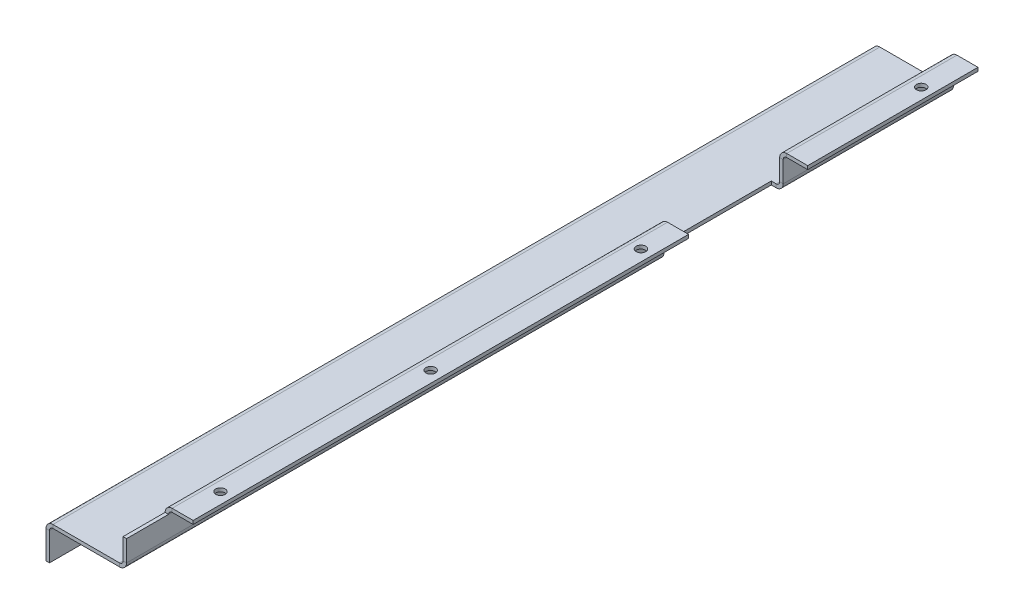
ISO-10303-21;
HEADER;
FILE_DESCRIPTION(('STEP AP214'),'2;1');
FILE_NAME('part.step','',(''),(''),'','','');
FILE_SCHEMA(('AUTOMOTIVE_DESIGN { 1 0 10303 214 1 1 1 1 }'));
ENDSEC;
DATA;
#1=APPLICATION_CONTEXT('core data for automotive mechanical design processes');
#2=APPLICATION_PROTOCOL_DEFINITION('international standard','automotive_design',2000,#1);
#3=PRODUCT_CONTEXT('',#1,'mechanical');
#4=PRODUCT('Part','Part','',(#3));
#5=PRODUCT_RELATED_PRODUCT_CATEGORY('part','',(#4));
#6=PRODUCT_DEFINITION_FORMATION('','',#4);
#7=PRODUCT_DEFINITION_CONTEXT('part definition',#1,'design');
#8=PRODUCT_DEFINITION('design','',#6,#7);
#9=PRODUCT_DEFINITION_SHAPE('','',#8);
#10=(LENGTH_UNIT() NAMED_UNIT(*) SI_UNIT(.MILLI.,.METRE.));
#11=(NAMED_UNIT(*) PLANE_ANGLE_UNIT() SI_UNIT($,.RADIAN.));
#12=(NAMED_UNIT(*) SI_UNIT($,.STERADIAN.) SOLID_ANGLE_UNIT());
#13=UNCERTAINTY_MEASURE_WITH_UNIT(LENGTH_MEASURE(1.E-05),#10,'distance_accuracy_value','');
#14=(GEOMETRIC_REPRESENTATION_CONTEXT(3) GLOBAL_UNCERTAINTY_ASSIGNED_CONTEXT((#13)) GLOBAL_UNIT_ASSIGNED_CONTEXT((#10,
#11,#12)) REPRESENTATION_CONTEXT('',''));
#15=CARTESIAN_POINT('',(0.,0.,0.));
#16=DIRECTION('',(0.,0.,1.));
#17=DIRECTION('',(1.,0.,0.));
#18=AXIS2_PLACEMENT_3D('',#15,#16,#17);
#19=CARTESIAN_POINT('',(55.,44.9999999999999,-590.));
#20=DIRECTION('',(0.,-1.,0.));
#21=DIRECTION('',(0.,0.,-1.));
#22=AXIS2_PLACEMENT_3D('',#19,#20,#21);
#23=PLANE('',#22);
#24=CARTESIAN_POINT('',(66.9999999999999,44.9999999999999,-557.5));
#25=DIRECTION('',(0.,-1.,0.));
#26=DIRECTION('',(0.,0.,-1.));
#27=AXIS2_PLACEMENT_3D('',#24,#25,#26);
#28=CIRCLE('',#27,3.39999999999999);
#29=CARTESIAN_POINT('',(66.9999999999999,44.9999999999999,-560.9));
#30=VERTEX_POINT('',#29);
#31=EDGE_CURVE('E820',#30,#30,#28,.T.);
#32=ORIENTED_EDGE('',*,*,#31,.F.);
#33=EDGE_LOOP('',(#32));
#34=FACE_BOUND('',#33,.T.);
#35=DIRECTION('',(0.,0.,1.));
#36=VECTOR('',#35,1.);
#37=CARTESIAN_POINT('',(75.,44.9999999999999,-590.));
#38=LINE('',#37,#36);
#39=CARTESIAN_POINT('',(75.,44.9999999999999,-590.));
#40=VERTEX_POINT('',#39);
#41=CARTESIAN_POINT('',(75.,44.9999999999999,-468.5));
#42=VERTEX_POINT('',#41);
#43=EDGE_CURVE('E300',#40,#42,#38,.T.);
#44=ORIENTED_EDGE('',*,*,#43,.T.);
#45=DIRECTION('',(1.,0.,0.));
#46=VECTOR('',#45,1.);
#47=CARTESIAN_POINT('',(54.9999999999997,44.9999999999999,-468.5));
#48=LINE('',#47,#46);
#49=CARTESIAN_POINT('',(60.,44.9999999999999,-468.5));
#50=VERTEX_POINT('',#49);
#51=EDGE_CURVE('E642',#50,#42,#48,.T.);
#52=ORIENTED_EDGE('',*,*,#51,.F.);
#53=DIRECTION('',(0.,0.,1.));
#54=VECTOR('',#53,1.);
#55=CARTESIAN_POINT('',(60.,44.9999999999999,-590.));
#56=LINE('',#55,#54);
#57=CARTESIAN_POINT('',(60.,44.9999999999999,-590.));
#58=VERTEX_POINT('',#57);
#59=EDGE_CURVE('E309',#58,#50,#56,.T.);
#60=ORIENTED_EDGE('',*,*,#59,.F.);
#61=DIRECTION('',(1.,0.,0.));
#62=VECTOR('',#61,1.);
#63=CARTESIAN_POINT('',(55.,44.9999999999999,-590.));
#64=LINE('',#63,#62);
#65=EDGE_CURVE('E479',#58,#40,#64,.T.);
#66=ORIENTED_EDGE('',*,*,#65,.T.);
#67=EDGE_LOOP('',(#44,#52,#60,#66));
#68=FACE_BOUND('',#67,.T.);
#69=ADVANCED_FACE('F38',(#34,#68),#23,.T.);
#70=CARTESIAN_POINT('',(66.9999999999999,44.9999999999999,-207.5));
#71=DIRECTION('',(0.,-1.,0.));
#72=DIRECTION('',(0.,0.,-1.));
#73=AXIS2_PLACEMENT_3D('',#70,#71,#72);
#74=CIRCLE('',#73,3.39999999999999);
#75=CARTESIAN_POINT('',(66.9999999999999,44.9999999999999,-210.9));
#76=VERTEX_POINT('',#75);
#77=EDGE_CURVE('E823',#76,#76,#74,.T.);
#78=ORIENTED_EDGE('',*,*,#77,.F.);
#79=EDGE_LOOP('',(#78));
#80=FACE_BOUND('',#79,.T.);
#81=CARTESIAN_POINT('',(66.9999999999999,44.9999999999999,-357.5));
#82=DIRECTION('',(0.,-1.,0.));
#83=DIRECTION('',(0.,0.,-1.));
#84=AXIS2_PLACEMENT_3D('',#81,#82,#83);
#85=CIRCLE('',#84,3.39999999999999);
#86=CARTESIAN_POINT('',(66.9999999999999,44.9999999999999,-360.9));
#87=VERTEX_POINT('',#86);
#88=EDGE_CURVE('E813',#87,#87,#85,.T.);
#89=ORIENTED_EDGE('',*,*,#88,.F.);
#90=EDGE_LOOP('',(#89));
#91=FACE_BOUND('',#90,.T.);
#92=CARTESIAN_POINT('',(66.9999999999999,44.9999999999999,-57.5));
#93=DIRECTION('',(0.,-1.,0.));
#94=DIRECTION('',(0.,0.,-1.));
#95=AXIS2_PLACEMENT_3D('',#92,#93,#94);
#96=CIRCLE('',#95,3.39999999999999);
#97=CARTESIAN_POINT('',(66.9999999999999,44.9999999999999,-60.9));
#98=VERTEX_POINT('',#97);
#99=EDGE_CURVE('E834',#98,#98,#96,.T.);
#100=ORIENTED_EDGE('',*,*,#99,.F.);
#101=EDGE_LOOP('',(#100));
#102=FACE_BOUND('',#101,.T.);
#103=CARTESIAN_POINT('',(60.,44.9999999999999,-383.5));
#104=VERTEX_POINT('',#103);
#105=CARTESIAN_POINT('',(60.,44.9999999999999,-30.));
#106=VERTEX_POINT('',#105);
#107=EDGE_CURVE('E410',#104,#106,#56,.T.);
#108=ORIENTED_EDGE('',*,*,#107,.F.);
#109=DIRECTION('',(-1.,0.,0.));
#110=VECTOR('',#109,1.);
#111=CARTESIAN_POINT('',(55.,44.9999999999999,-383.5));
#112=LINE('',#111,#110);
#113=CARTESIAN_POINT('',(75.,44.9999999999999,-383.5));
#114=VERTEX_POINT('',#113);
#115=EDGE_CURVE('E644',#114,#104,#112,.T.);
#116=ORIENTED_EDGE('',*,*,#115,.F.);
#117=CARTESIAN_POINT('',(75.,44.9999999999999,-30.));
#118=VERTEX_POINT('',#117);
#119=EDGE_CURVE('E62',#114,#118,#38,.T.);
#120=ORIENTED_EDGE('',*,*,#119,.T.);
#121=DIRECTION('',(1.,0.,0.));
#122=VECTOR('',#121,1.);
#123=CARTESIAN_POINT('',(54.9999999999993,44.9999999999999,-30.));
#124=LINE('',#123,#122);
#125=EDGE_CURVE('E720',#106,#118,#124,.T.);
#126=ORIENTED_EDGE('',*,*,#125,.F.);
#127=EDGE_LOOP('',(#108,#116,#120,#126));
#128=FACE_BOUND('',#127,.T.);
#129=ADVANCED_FACE('F554',(#80,#91,#102,#128),#23,.T.);
#130=CARTESIAN_POINT('',(60.,42.5,-590.));
#131=DIRECTION('',(0.,0.,1.));
#132=DIRECTION('',(1.,0.,0.));
#133=AXIS2_PLACEMENT_3D('',#130,#131,#132);
#134=CYLINDRICAL_SURFACE('',#133,2.5);
#135=ORIENTED_EDGE('',*,*,#59,.T.);
#136=CARTESIAN_POINT('',(60.,42.5,-468.5));
#137=DIRECTION('',(0.,0.,1.));
#138=DIRECTION('',(1.,0.,0.));
#139=AXIS2_PLACEMENT_3D('',#136,#137,#138);
#140=CIRCLE('',#139,2.5);
#141=CARTESIAN_POINT('',(57.5,42.5,-468.5));
#142=VERTEX_POINT('',#141);
#143=EDGE_CURVE('E510',#142,#50,#140,.F.);
#144=ORIENTED_EDGE('',*,*,#143,.F.);
#145=DIRECTION('',(0.,0.,1.));
#146=VECTOR('',#145,1.);
#147=CARTESIAN_POINT('',(57.5,42.5,-590.));
#148=LINE('',#147,#146);
#149=CARTESIAN_POINT('',(57.5,42.5,-590.));
#150=VERTEX_POINT('',#149);
#151=EDGE_CURVE('E411',#150,#142,#148,.T.);
#152=ORIENTED_EDGE('',*,*,#151,.F.);
#153=CARTESIAN_POINT('',(60.,42.5,-590.));
#154=DIRECTION('',(0.,0.,1.));
#155=DIRECTION('',(1.,0.,0.));
#156=AXIS2_PLACEMENT_3D('',#153,#154,#155);
#157=CIRCLE('',#156,2.5);
#158=EDGE_CURVE('E403',#150,#58,#157,.F.);
#159=ORIENTED_EDGE('',*,*,#158,.T.);
#160=EDGE_LOOP('',(#135,#144,#152,#159));
#161=FACE_BOUND('',#160,.T.);
#162=ADVANCED_FACE('F508',(#161),#134,.F.);
#163=CARTESIAN_POINT('',(57.5,42.5,-383.5));
#164=VERTEX_POINT('',#163);
#165=CARTESIAN_POINT('',(57.5,42.5,-30.));
#166=VERTEX_POINT('',#165);
#167=EDGE_CURVE('E415',#164,#166,#148,.T.);
#168=ORIENTED_EDGE('',*,*,#167,.F.);
#169=CARTESIAN_POINT('',(60.,42.5,-383.5));
#170=DIRECTION('',(0.,0.,1.));
#171=DIRECTION('',(1.,0.,0.));
#172=AXIS2_PLACEMENT_3D('',#169,#170,#171);
#173=CIRCLE('',#172,2.5);
#174=EDGE_CURVE('E781',#104,#164,#173,.T.);
#175=ORIENTED_EDGE('',*,*,#174,.F.);
#176=ORIENTED_EDGE('',*,*,#107,.T.);
#177=CARTESIAN_POINT('',(60.,42.5,-30.));
#178=DIRECTION('',(0.,0.,-1.));
#179=DIRECTION('',(-1.,0.,0.));
#180=AXIS2_PLACEMENT_3D('',#177,#178,#179);
#181=CIRCLE('',#180,2.5);
#182=EDGE_CURVE('E705',#166,#106,#181,.T.);
#183=ORIENTED_EDGE('',*,*,#182,.F.);
#184=EDGE_LOOP('',(#168,#175,#176,#183));
#185=FACE_BOUND('',#184,.T.);
#186=ADVANCED_FACE('F608',(#185),#134,.F.);
#187=CARTESIAN_POINT('',(60.,42.5,-590.));
#188=DIRECTION('',(0.,0.,1.));
#189=DIRECTION('',(1.,0.,0.));
#190=AXIS2_PLACEMENT_3D('',#187,#188,#189);
#191=CYLINDRICAL_SURFACE('',#190,5.);
#192=CARTESIAN_POINT('',(60.,42.5,-468.5));
#193=DIRECTION('',(0.,0.,-1.));
#194=DIRECTION('',(-1.,0.,0.));
#195=AXIS2_PLACEMENT_3D('',#192,#193,#194);
#196=CIRCLE('',#195,5.);
#197=CARTESIAN_POINT('',(55.,42.5,-468.5));
#198=VERTEX_POINT('',#197);
#199=CARTESIAN_POINT('',(60.,47.5000000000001,-468.5));
#200=VERTEX_POINT('',#199);
#201=EDGE_CURVE('E778',#198,#200,#196,.T.);
#202=ORIENTED_EDGE('',*,*,#201,.T.);
#203=DIRECTION('',(0.,0.,1.));
#204=VECTOR('',#203,1.);
#205=CARTESIAN_POINT('',(60.,47.5000000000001,-590.));
#206=LINE('',#205,#204);
#207=CARTESIAN_POINT('',(60.,47.5000000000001,-590.));
#208=VERTEX_POINT('',#207);
#209=EDGE_CURVE('E290',#208,#200,#206,.T.);
#210=ORIENTED_EDGE('',*,*,#209,.F.);
#211=CARTESIAN_POINT('',(60.,42.5,-590.));
#212=DIRECTION('',(0.,0.,1.));
#213=DIRECTION('',(1.,0.,0.));
#214=AXIS2_PLACEMENT_3D('',#211,#212,#213);
#215=CIRCLE('',#214,5.);
#216=CARTESIAN_POINT('',(55.,42.5,-590.));
#217=VERTEX_POINT('',#216);
#218=EDGE_CURVE('E489',#217,#208,#215,.F.);
#219=ORIENTED_EDGE('',*,*,#218,.F.);
#220=DIRECTION('',(0.,0.,1.));
#221=VECTOR('',#220,1.);
#222=CARTESIAN_POINT('',(55.,42.5,-590.));
#223=LINE('',#222,#221);
#224=EDGE_CURVE('E284',#217,#198,#223,.T.);
#225=ORIENTED_EDGE('',*,*,#224,.T.);
#226=EDGE_LOOP('',(#202,#210,#219,#225));
#227=FACE_BOUND('',#226,.T.);
#228=ADVANCED_FACE('F501',(#227),#191,.T.);
#229=CARTESIAN_POINT('',(60.,42.5,-383.5));
#230=DIRECTION('',(0.,0.,1.));
#231=DIRECTION('',(1.,0.,0.));
#232=AXIS2_PLACEMENT_3D('',#229,#230,#231);
#233=CIRCLE('',#232,5.);
#234=CARTESIAN_POINT('',(60.,47.5000000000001,-383.5));
#235=VERTEX_POINT('',#234);
#236=CARTESIAN_POINT('',(55.,42.5,-383.5));
#237=VERTEX_POINT('',#236);
#238=EDGE_CURVE('E774',#235,#237,#233,.T.);
#239=ORIENTED_EDGE('',*,*,#238,.T.);
#240=CARTESIAN_POINT('',(55.,42.5,-30.));
#241=VERTEX_POINT('',#240);
#242=EDGE_CURVE('E289',#237,#241,#223,.T.);
#243=ORIENTED_EDGE('',*,*,#242,.T.);
#244=CARTESIAN_POINT('',(60.,42.5,-30.));
#245=DIRECTION('',(0.,0.,1.));
#246=DIRECTION('',(1.,0.,0.));
#247=AXIS2_PLACEMENT_3D('',#244,#245,#246);
#248=CIRCLE('',#247,5.);
#249=CARTESIAN_POINT('',(60.,47.5000000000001,-30.));
#250=VERTEX_POINT('',#249);
#251=EDGE_CURVE('E712',#241,#250,#248,.F.);
#252=ORIENTED_EDGE('',*,*,#251,.T.);
#253=EDGE_CURVE('E294',#235,#250,#206,.T.);
#254=ORIENTED_EDGE('',*,*,#253,.F.);
#255=EDGE_LOOP('',(#239,#243,#252,#254));
#256=FACE_BOUND('',#255,.T.);
#257=ADVANCED_FACE('F607',(#256),#191,.T.);
#258=CARTESIAN_POINT('',(55.,47.5000000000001,-590.));
#259=DIRECTION('',(0.,-1.,0.));
#260=DIRECTION('',(0.,0.,-1.));
#261=AXIS2_PLACEMENT_3D('',#258,#259,#260);
#262=PLANE('',#261);
#263=CARTESIAN_POINT('',(66.9999999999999,47.5000000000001,-557.5));
#264=DIRECTION('',(0.,1.,0.));
#265=DIRECTION('',(0.,0.,1.));
#266=AXIS2_PLACEMENT_3D('',#263,#264,#265);
#267=CIRCLE('',#266,3.39999999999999);
#268=CARTESIAN_POINT('',(66.9999999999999,47.5000000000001,-554.1));
#269=VERTEX_POINT('',#268);
#270=EDGE_CURVE('E622',#269,#269,#267,.T.);
#271=ORIENTED_EDGE('',*,*,#270,.F.);
#272=EDGE_LOOP('',(#271));
#273=FACE_BOUND('',#272,.T.);
#274=DIRECTION('',(1.,0.,0.));
#275=VECTOR('',#274,1.);
#276=CARTESIAN_POINT('',(55.,47.5000000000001,-468.5));
#277=LINE('',#276,#275);
#278=CARTESIAN_POINT('',(75.,47.5000000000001,-468.5));
#279=VERTEX_POINT('',#278);
#280=EDGE_CURVE('E625',#200,#279,#277,.T.);
#281=ORIENTED_EDGE('',*,*,#280,.T.);
#282=DIRECTION('',(0.,0.,1.));
#283=VECTOR('',#282,1.);
#284=CARTESIAN_POINT('',(75.,47.5000000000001,-590.));
#285=LINE('',#284,#283);
#286=CARTESIAN_POINT('',(75.,47.5000000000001,-590.));
#287=VERTEX_POINT('',#286);
#288=EDGE_CURVE('E295',#287,#279,#285,.T.);
#289=ORIENTED_EDGE('',*,*,#288,.F.);
#290=DIRECTION('',(1.,0.,0.));
#291=VECTOR('',#290,1.);
#292=CARTESIAN_POINT('',(55.,47.5000000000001,-590.));
#293=LINE('',#292,#291);
#294=EDGE_CURVE('E486',#208,#287,#293,.T.);
#295=ORIENTED_EDGE('',*,*,#294,.F.);
#296=ORIENTED_EDGE('',*,*,#209,.T.);
#297=EDGE_LOOP('',(#281,#289,#295,#296));
#298=FACE_BOUND('',#297,.T.);
#299=ADVANCED_FACE('F609',(#273,#298),#262,.F.);
#300=CARTESIAN_POINT('',(66.9999999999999,47.5000000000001,-207.5));
#301=DIRECTION('',(0.,1.,0.));
#302=DIRECTION('',(0.,0.,1.));
#303=AXIS2_PLACEMENT_3D('',#300,#301,#302);
#304=CIRCLE('',#303,3.39999999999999);
#305=CARTESIAN_POINT('',(66.9999999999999,47.5000000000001,-204.1));
#306=VERTEX_POINT('',#305);
#307=EDGE_CURVE('E1446',#306,#306,#304,.T.);
#308=ORIENTED_EDGE('',*,*,#307,.F.);
#309=EDGE_LOOP('',(#308));
#310=FACE_BOUND('',#309,.T.);
#311=CARTESIAN_POINT('',(66.9999999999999,47.5000000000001,-357.5));
#312=DIRECTION('',(0.,1.,0.));
#313=DIRECTION('',(0.,0.,1.));
#314=AXIS2_PLACEMENT_3D('',#311,#312,#313);
#315=CIRCLE('',#314,3.39999999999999);
#316=CARTESIAN_POINT('',(66.9999999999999,47.5000000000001,-354.1));
#317=VERTEX_POINT('',#316);
#318=EDGE_CURVE('E815',#317,#317,#315,.T.);
#319=ORIENTED_EDGE('',*,*,#318,.F.);
#320=EDGE_LOOP('',(#319));
#321=FACE_BOUND('',#320,.T.);
#322=CARTESIAN_POINT('',(66.9999999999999,47.5000000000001,-57.5));
#323=DIRECTION('',(0.,1.,0.));
#324=DIRECTION('',(0.,0.,1.));
#325=AXIS2_PLACEMENT_3D('',#322,#323,#324);
#326=CIRCLE('',#325,3.39999999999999);
#327=CARTESIAN_POINT('',(66.9999999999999,47.5000000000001,-54.1));
#328=VERTEX_POINT('',#327);
#329=EDGE_CURVE('E830',#328,#328,#326,.T.);
#330=ORIENTED_EDGE('',*,*,#329,.F.);
#331=EDGE_LOOP('',(#330));
#332=FACE_BOUND('',#331,.T.);
#333=DIRECTION('',(1.,0.,0.));
#334=VECTOR('',#333,1.);
#335=CARTESIAN_POINT('',(55.,47.5000000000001,-383.5));
#336=LINE('',#335,#334);
#337=CARTESIAN_POINT('',(75.,47.5000000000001,-383.5));
#338=VERTEX_POINT('',#337);
#339=EDGE_CURVE('E632',#338,#235,#336,.F.);
#340=ORIENTED_EDGE('',*,*,#339,.T.);
#341=ORIENTED_EDGE('',*,*,#253,.T.);
#342=DIRECTION('',(1.,0.,0.));
#343=VECTOR('',#342,1.);
#344=CARTESIAN_POINT('',(55.,47.5000000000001,-30.));
#345=LINE('',#344,#343);
#346=CARTESIAN_POINT('',(75.,47.5000000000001,-30.));
#347=VERTEX_POINT('',#346);
#348=EDGE_CURVE('E723',#250,#347,#345,.T.);
#349=ORIENTED_EDGE('',*,*,#348,.T.);
#350=EDGE_CURVE('E299',#338,#347,#285,.T.);
#351=ORIENTED_EDGE('',*,*,#350,.F.);
#352=EDGE_LOOP('',(#340,#341,#349,#351));
#353=FACE_BOUND('',#352,.T.);
#354=ADVANCED_FACE('F611',(#310,#321,#332,#353),#262,.F.);
#355=CARTESIAN_POINT('',(75.,47.5000000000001,-590.));
#356=DIRECTION('',(-1.,0.,0.));
#357=DIRECTION('',(0.,0.,1.));
#358=AXIS2_PLACEMENT_3D('',#355,#356,#357);
#359=PLANE('',#358);
#360=DIRECTION('',(0.,-1.,0.));
#361=VECTOR('',#360,1.);
#362=CARTESIAN_POINT('',(75.,44.9999999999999,-468.5));
#363=LINE('',#362,#361);
#364=EDGE_CURVE('E637',#42,#279,#363,.F.);
#365=ORIENTED_EDGE('',*,*,#364,.F.);
#366=ORIENTED_EDGE('',*,*,#43,.F.);
#367=DIRECTION('',(0.,-1.,0.));
#368=VECTOR('',#367,1.);
#369=CARTESIAN_POINT('',(75.,47.5000000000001,-590.));
#370=LINE('',#369,#368);
#371=EDGE_CURVE('E483',#287,#40,#370,.T.);
#372=ORIENTED_EDGE('',*,*,#371,.F.);
#373=ORIENTED_EDGE('',*,*,#288,.T.);
#374=EDGE_LOOP('',(#365,#366,#372,#373));
#375=FACE_BOUND('',#374,.T.);
#376=ADVANCED_FACE('F565',(#375),#359,.F.);
#377=DIRECTION('',(0.,-1.,0.));
#378=VECTOR('',#377,1.);
#379=CARTESIAN_POINT('',(75.,44.9999999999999,-383.5));
#380=LINE('',#379,#378);
#381=EDGE_CURVE('E631',#114,#338,#380,.F.);
#382=ORIENTED_EDGE('',*,*,#381,.T.);
#383=ORIENTED_EDGE('',*,*,#350,.T.);
#384=DIRECTION('',(0.,-1.,0.));
#385=VECTOR('',#384,1.);
#386=CARTESIAN_POINT('',(75.,44.9999999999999,-30.));
#387=LINE('',#386,#385);
#388=EDGE_CURVE('E728',#118,#347,#387,.F.);
#389=ORIENTED_EDGE('',*,*,#388,.F.);
#390=ORIENTED_EDGE('',*,*,#119,.F.);
#391=EDGE_LOOP('',(#382,#383,#389,#390));
#392=FACE_BOUND('',#391,.T.);
#393=ADVANCED_FACE('F915',(#392),#359,.F.);
#394=CARTESIAN_POINT('',(57.5,24.9999999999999,-590.));
#395=DIRECTION('',(1.,0.,0.));
#396=DIRECTION('',(0.,0.,-1.));
#397=AXIS2_PLACEMENT_3D('',#394,#395,#396);
#398=PLANE('',#397);
#399=ORIENTED_EDGE('',*,*,#151,.T.);
#400=DIRECTION('',(0.,1.,0.));
#401=VECTOR('',#400,1.);
#402=CARTESIAN_POINT('',(57.5,24.9999999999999,-468.5));
#403=LINE('',#402,#401);
#404=CARTESIAN_POINT('',(57.5,27.5000000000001,-468.5));
#405=VERTEX_POINT('',#404);
#406=EDGE_CURVE('E790',#405,#142,#403,.T.);
#407=ORIENTED_EDGE('',*,*,#406,.F.);
#408=DIRECTION('',(0.,0.,1.));
#409=VECTOR('',#408,1.);
#410=CARTESIAN_POINT('',(57.5,27.5000000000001,-590.));
#411=LINE('',#410,#409);
#412=CARTESIAN_POINT('',(57.5,27.5000000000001,-590.));
#413=VERTEX_POINT('',#412);
#414=EDGE_CURVE('E416',#413,#405,#411,.T.);
#415=ORIENTED_EDGE('',*,*,#414,.F.);
#416=DIRECTION('',(0.,1.,0.));
#417=VECTOR('',#416,1.);
#418=CARTESIAN_POINT('',(57.5,24.9999999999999,-590.));
#419=LINE('',#418,#417);
#420=EDGE_CURVE('E399',#413,#150,#419,.T.);
#421=ORIENTED_EDGE('',*,*,#420,.T.);
#422=EDGE_LOOP('',(#399,#407,#415,#421));
#423=FACE_BOUND('',#422,.T.);
#424=ADVANCED_FACE('F513',(#423),#398,.T.);
#425=CARTESIAN_POINT('',(57.5,27.5000000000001,-383.5));
#426=VERTEX_POINT('',#425);
#427=CARTESIAN_POINT('',(57.5,27.5000000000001,0.));
#428=VERTEX_POINT('',#427);
#429=EDGE_CURVE('E420',#426,#428,#411,.T.);
#430=ORIENTED_EDGE('',*,*,#429,.F.);
#431=DIRECTION('',(0.,1.,0.));
#432=VECTOR('',#431,1.);
#433=CARTESIAN_POINT('',(57.5,24.9999999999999,-383.5));
#434=LINE('',#433,#432);
#435=EDGE_CURVE('E246',#164,#426,#434,.F.);
#436=ORIENTED_EDGE('',*,*,#435,.F.);
#437=ORIENTED_EDGE('',*,*,#167,.T.);
#438=DIRECTION('',(0.,0.,1.));
#439=VECTOR('',#438,1.);
#440=CARTESIAN_POINT('',(57.5,42.5,-590.));
#441=LINE('',#440,#439);
#442=CARTESIAN_POINT('',(57.5,42.5,0.));
#443=VERTEX_POINT('',#442);
#444=EDGE_CURVE('E699',#166,#443,#441,.T.);
#445=ORIENTED_EDGE('',*,*,#444,.T.);
#446=DIRECTION('',(0.,1.,0.));
#447=VECTOR('',#446,1.);
#448=CARTESIAN_POINT('',(57.5,24.9999999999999,0.));
#449=LINE('',#448,#447);
#450=EDGE_CURVE('E475',#428,#443,#449,.T.);
#451=ORIENTED_EDGE('',*,*,#450,.F.);
#452=EDGE_LOOP('',(#430,#436,#437,#445,#451));
#453=FACE_BOUND('',#452,.T.);
#454=ADVANCED_FACE('F805',(#453),#398,.T.);
#455=CARTESIAN_POINT('',(52.5,27.5000000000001,-590.));
#456=DIRECTION('',(0.,0.,1.));
#457=DIRECTION('',(1.,0.,0.));
#458=AXIS2_PLACEMENT_3D('',#455,#456,#457);
#459=CYLINDRICAL_SURFACE('',#458,5.);
#460=ORIENTED_EDGE('',*,*,#414,.T.);
#461=CARTESIAN_POINT('',(52.5,27.5000000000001,-468.5));
#462=DIRECTION('',(0.,0.,1.));
#463=DIRECTION('',(1.,0.,0.));
#464=AXIS2_PLACEMENT_3D('',#461,#462,#463);
#465=CIRCLE('',#464,5.);
#466=CARTESIAN_POINT('',(52.5,22.5,-468.5));
#467=VERTEX_POINT('',#466);
#468=EDGE_CURVE('E256',#467,#405,#465,.T.);
#469=ORIENTED_EDGE('',*,*,#468,.F.);
#470=DIRECTION('',(0.,0.,1.));
#471=VECTOR('',#470,1.);
#472=CARTESIAN_POINT('',(52.5,22.5,-590.));
#473=LINE('',#472,#471);
#474=CARTESIAN_POINT('',(52.5,22.5,-590.));
#475=VERTEX_POINT('',#474);
#476=EDGE_CURVE('E421',#475,#467,#473,.T.);
#477=ORIENTED_EDGE('',*,*,#476,.F.);
#478=CARTESIAN_POINT('',(52.5,27.5000000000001,-590.));
#479=DIRECTION('',(0.,0.,1.));
#480=DIRECTION('',(1.,0.,0.));
#481=AXIS2_PLACEMENT_3D('',#478,#479,#480);
#482=CIRCLE('',#481,5.);
#483=EDGE_CURVE('E395',#475,#413,#482,.T.);
#484=ORIENTED_EDGE('',*,*,#483,.T.);
#485=EDGE_LOOP('',(#460,#469,#477,#484));
#486=FACE_BOUND('',#485,.T.);
#487=ADVANCED_FACE('F517',(#486),#459,.T.);
#488=CARTESIAN_POINT('',(52.5,22.5,-383.5));
#489=VERTEX_POINT('',#488);
#490=CARTESIAN_POINT('',(52.5,22.5,0.));
#491=VERTEX_POINT('',#490);
#492=EDGE_CURVE('E425',#489,#491,#473,.T.);
#493=ORIENTED_EDGE('',*,*,#492,.F.);
#494=CARTESIAN_POINT('',(52.5,27.5000000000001,-383.5));
#495=DIRECTION('',(0.,0.,1.));
#496=DIRECTION('',(1.,0.,0.));
#497=AXIS2_PLACEMENT_3D('',#494,#495,#496);
#498=CIRCLE('',#497,5.);
#499=EDGE_CURVE('E270',#426,#489,#498,.F.);
#500=ORIENTED_EDGE('',*,*,#499,.F.);
#501=ORIENTED_EDGE('',*,*,#429,.T.);
#502=CARTESIAN_POINT('',(52.5,27.5000000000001,0.));
#503=DIRECTION('',(0.,0.,1.));
#504=DIRECTION('',(1.,0.,0.));
#505=AXIS2_PLACEMENT_3D('',#502,#503,#504);
#506=CIRCLE('',#505,5.);
#507=EDGE_CURVE('E472',#491,#428,#506,.T.);
#508=ORIENTED_EDGE('',*,*,#507,.F.);
#509=EDGE_LOOP('',(#493,#500,#501,#508));
#510=FACE_BOUND('',#509,.T.);
#511=ADVANCED_FACE('F752',(#510),#459,.T.);
#512=CARTESIAN_POINT('',(0.,22.5,-590.));
#513=DIRECTION('',(0.,-1.,0.));
#514=DIRECTION('',(0.,0.,-1.));
#515=AXIS2_PLACEMENT_3D('',#512,#513,#514);
#516=PLANE('',#515);
#517=ORIENTED_EDGE('',*,*,#476,.T.);
#518=DIRECTION('',(1.,0.,0.));
#519=VECTOR('',#518,1.);
#520=CARTESIAN_POINT('',(-2.22044604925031E-13,22.5,-468.5));
#521=LINE('',#520,#519);
#522=CARTESIAN_POINT('',(49.,22.5,-468.5));
#523=VERTEX_POINT('',#522);
#524=EDGE_CURVE('E673',#523,#467,#521,.T.);
#525=ORIENTED_EDGE('',*,*,#524,.F.);
#526=DIRECTION('',(0.,0.,-1.));
#527=VECTOR('',#526,1.);
#528=CARTESIAN_POINT('',(49.,22.5,-590.));
#529=LINE('',#528,#527);
#530=CARTESIAN_POINT('',(49.,22.5,-383.5));
#531=VERTEX_POINT('',#530);
#532=EDGE_CURVE('E670',#531,#523,#529,.T.);
#533=ORIENTED_EDGE('',*,*,#532,.F.);
#534=DIRECTION('',(-1.,0.,0.));
#535=VECTOR('',#534,1.);
#536=CARTESIAN_POINT('',(0.,22.5,-383.5));
#537=LINE('',#536,#535);
#538=EDGE_CURVE('E664',#489,#531,#537,.T.);
#539=ORIENTED_EDGE('',*,*,#538,.F.);
#540=ORIENTED_EDGE('',*,*,#492,.T.);
#541=DIRECTION('',(1.,0.,0.));
#542=VECTOR('',#541,1.);
#543=CARTESIAN_POINT('',(0.,22.5,0.));
#544=LINE('',#543,#542);
#545=CARTESIAN_POINT('',(5.,22.5,0.));
#546=VERTEX_POINT('',#545);
#547=EDGE_CURVE('E469',#546,#491,#544,.T.);
#548=ORIENTED_EDGE('',*,*,#547,.F.);
#549=DIRECTION('',(0.,0.,1.));
#550=VECTOR('',#549,1.);
#551=CARTESIAN_POINT('',(5.,22.5,-590.));
#552=LINE('',#551,#550);
#553=CARTESIAN_POINT('',(5.,22.5,-590.));
#554=VERTEX_POINT('',#553);
#555=EDGE_CURVE('E426',#554,#546,#552,.T.);
#556=ORIENTED_EDGE('',*,*,#555,.F.);
#557=DIRECTION('',(1.,0.,0.));
#558=VECTOR('',#557,1.);
#559=CARTESIAN_POINT('',(0.,22.5,-590.));
#560=LINE('',#559,#558);
#561=EDGE_CURVE('E345',#554,#475,#560,.T.);
#562=ORIENTED_EDGE('',*,*,#561,.T.);
#563=EDGE_LOOP('',(#517,#525,#533,#539,#540,#548,#556,#562));
#564=FACE_BOUND('',#563,.T.);
#565=ADVANCED_FACE('F521',(#564),#516,.T.);
#566=CARTESIAN_POINT('',(0.,24.9999999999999,-590.));
#567=DIRECTION('',(0.,-1.,0.));
#568=DIRECTION('',(0.,0.,-1.));
#569=AXIS2_PLACEMENT_3D('',#566,#567,#568);
#570=PLANE('',#569);
#571=DIRECTION('',(1.,0.,0.));
#572=VECTOR('',#571,1.);
#573=CARTESIAN_POINT('',(0.,24.9999999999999,-468.5));
#574=LINE('',#573,#572);
#575=CARTESIAN_POINT('',(49.,24.9999999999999,-468.5));
#576=VERTEX_POINT('',#575);
#577=CARTESIAN_POINT('',(52.5,24.9999999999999,-468.5));
#578=VERTEX_POINT('',#577);
#579=EDGE_CURVE('E677',#576,#578,#574,.T.);
#580=ORIENTED_EDGE('',*,*,#579,.T.);
#581=DIRECTION('',(0.,0.,1.));
#582=VECTOR('',#581,1.);
#583=CARTESIAN_POINT('',(52.5,24.9999999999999,-590.));
#584=LINE('',#583,#582);
#585=CARTESIAN_POINT('',(52.5,24.9999999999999,-590.));
#586=VERTEX_POINT('',#585);
#587=EDGE_CURVE('E268',#586,#578,#584,.T.);
#588=ORIENTED_EDGE('',*,*,#587,.F.);
#589=DIRECTION('',(1.,0.,0.));
#590=VECTOR('',#589,1.);
#591=CARTESIAN_POINT('',(0.,24.9999999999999,-590.));
#592=LINE('',#591,#590);
#593=CARTESIAN_POINT('',(5.,24.9999999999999,-590.));
#594=VERTEX_POINT('',#593);
#595=EDGE_CURVE('E343',#594,#586,#592,.T.);
#596=ORIENTED_EDGE('',*,*,#595,.F.);
#597=DIRECTION('',(0.,0.,1.));
#598=VECTOR('',#597,1.);
#599=CARTESIAN_POINT('',(5.,24.9999999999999,-590.));
#600=LINE('',#599,#598);
#601=CARTESIAN_POINT('',(5.,24.9999999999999,0.));
#602=VERTEX_POINT('',#601);
#603=EDGE_CURVE('E361',#594,#602,#600,.T.);
#604=ORIENTED_EDGE('',*,*,#603,.T.);
#605=DIRECTION('',(1.,0.,0.));
#606=VECTOR('',#605,1.);
#607=CARTESIAN_POINT('',(0.,24.9999999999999,0.));
#608=LINE('',#607,#606);
#609=CARTESIAN_POINT('',(52.5,24.9999999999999,0.));
#610=VERTEX_POINT('',#609);
#611=EDGE_CURVE('E453',#602,#610,#608,.T.);
#612=ORIENTED_EDGE('',*,*,#611,.T.);
#613=CARTESIAN_POINT('',(52.5,24.9999999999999,-383.5));
#614=VERTEX_POINT('',#613);
#615=EDGE_CURVE('E276',#614,#610,#584,.T.);
#616=ORIENTED_EDGE('',*,*,#615,.F.);
#617=DIRECTION('',(1.,0.,0.));
#618=VECTOR('',#617,1.);
#619=CARTESIAN_POINT('',(0.,24.9999999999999,-383.5));
#620=LINE('',#619,#618);
#621=CARTESIAN_POINT('',(49.,24.9999999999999,-383.5));
#622=VERTEX_POINT('',#621);
#623=EDGE_CURVE('E676',#614,#622,#620,.F.);
#624=ORIENTED_EDGE('',*,*,#623,.T.);
#625=DIRECTION('',(0.,0.,-1.));
#626=VECTOR('',#625,1.);
#627=CARTESIAN_POINT('',(49.,24.9999999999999,-590.));
#628=LINE('',#627,#626);
#629=EDGE_CURVE('E681',#622,#576,#628,.T.);
#630=ORIENTED_EDGE('',*,*,#629,.T.);
#631=EDGE_LOOP('',(#580,#588,#596,#604,#612,#616,#624,#630));
#632=FACE_BOUND('',#631,.T.);
#633=ADVANCED_FACE('F371',(#632),#570,.F.);
#634=CARTESIAN_POINT('',(52.5,27.5000000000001,-590.));
#635=DIRECTION('',(0.,0.,1.));
#636=DIRECTION('',(1.,0.,0.));
#637=AXIS2_PLACEMENT_3D('',#634,#635,#636);
#638=CYLINDRICAL_SURFACE('',#637,2.5);
#639=CARTESIAN_POINT('',(52.5,27.5000000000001,-468.5));
#640=DIRECTION('',(0.,0.,-1.));
#641=DIRECTION('',(-1.,0.,0.));
#642=AXIS2_PLACEMENT_3D('',#639,#640,#641);
#643=CIRCLE('',#642,2.5);
#644=CARTESIAN_POINT('',(55.,27.5000000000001,-468.5));
#645=VERTEX_POINT('',#644);
#646=EDGE_CURVE('E253',#578,#645,#643,.F.);
#647=ORIENTED_EDGE('',*,*,#646,.T.);
#648=DIRECTION('',(0.,0.,1.));
#649=VECTOR('',#648,1.);
#650=CARTESIAN_POINT('',(55.,27.5000000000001,-590.));
#651=LINE('',#650,#649);
#652=CARTESIAN_POINT('',(55.,27.5000000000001,-590.));
#653=VERTEX_POINT('',#652);
#654=EDGE_CURVE('E265',#653,#645,#651,.T.);
#655=ORIENTED_EDGE('',*,*,#654,.F.);
#656=CARTESIAN_POINT('',(52.5,27.5000000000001,-590.));
#657=DIRECTION('',(0.,0.,-1.));
#658=DIRECTION('',(-1.,0.,0.));
#659=AXIS2_PLACEMENT_3D('',#656,#657,#658);
#660=CIRCLE('',#659,2.5);
#661=EDGE_CURVE('E373',#586,#653,#660,.F.);
#662=ORIENTED_EDGE('',*,*,#661,.F.);
#663=ORIENTED_EDGE('',*,*,#587,.T.);
#664=EDGE_LOOP('',(#647,#655,#662,#663));
#665=FACE_BOUND('',#664,.T.);
#666=ADVANCED_FACE('F263',(#665),#638,.F.);
#667=CARTESIAN_POINT('',(52.5,27.5000000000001,-383.5));
#668=DIRECTION('',(0.,0.,1.));
#669=DIRECTION('',(1.,0.,0.));
#670=AXIS2_PLACEMENT_3D('',#667,#668,#669);
#671=CIRCLE('',#670,2.5);
#672=CARTESIAN_POINT('',(55.,27.5000000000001,-383.5));
#673=VERTEX_POINT('',#672);
#674=EDGE_CURVE('E54',#673,#614,#671,.F.);
#675=ORIENTED_EDGE('',*,*,#674,.T.);
#676=ORIENTED_EDGE('',*,*,#615,.T.);
#677=CARTESIAN_POINT('',(52.5,27.5000000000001,0.));
#678=DIRECTION('',(0.,0.,-1.));
#679=DIRECTION('',(-1.,0.,0.));
#680=AXIS2_PLACEMENT_3D('',#677,#678,#679);
#681=CIRCLE('',#680,2.5);
#682=CARTESIAN_POINT('',(55.,27.5000000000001,0.));
#683=VERTEX_POINT('',#682);
#684=EDGE_CURVE('E457',#610,#683,#681,.F.);
#685=ORIENTED_EDGE('',*,*,#684,.T.);
#686=EDGE_CURVE('E277',#673,#683,#651,.T.);
#687=ORIENTED_EDGE('',*,*,#686,.F.);
#688=EDGE_LOOP('',(#675,#676,#685,#687));
#689=FACE_BOUND('',#688,.T.);
#690=ADVANCED_FACE('F601',(#689),#638,.F.);
#691=CARTESIAN_POINT('',(55.,24.9999999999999,-590.));
#692=DIRECTION('',(1.,0.,0.));
#693=DIRECTION('',(0.,0.,-1.));
#694=AXIS2_PLACEMENT_3D('',#691,#692,#693);
#695=PLANE('',#694);
#696=DIRECTION('',(0.,1.,0.));
#697=VECTOR('',#696,1.);
#698=CARTESIAN_POINT('',(55.,24.9999999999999,-468.5));
#699=LINE('',#698,#697);
#700=EDGE_CURVE('E234',#645,#198,#699,.T.);
#701=ORIENTED_EDGE('',*,*,#700,.T.);
#702=ORIENTED_EDGE('',*,*,#224,.F.);
#703=DIRECTION('',(0.,1.,0.));
#704=VECTOR('',#703,1.);
#705=CARTESIAN_POINT('',(55.,24.9999999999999,-590.));
#706=LINE('',#705,#704);
#707=EDGE_CURVE('E274',#653,#217,#706,.T.);
#708=ORIENTED_EDGE('',*,*,#707,.F.);
#709=ORIENTED_EDGE('',*,*,#654,.T.);
#710=EDGE_LOOP('',(#701,#702,#708,#709));
#711=FACE_BOUND('',#710,.T.);
#712=ADVANCED_FACE('F272',(#711),#695,.F.);
#713=DIRECTION('',(0.,-1.,0.));
#714=VECTOR('',#713,1.);
#715=CARTESIAN_POINT('',(55.,24.9999999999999,-383.5));
#716=LINE('',#715,#714);
#717=EDGE_CURVE('E247',#237,#673,#716,.T.);
#718=ORIENTED_EDGE('',*,*,#717,.T.);
#719=ORIENTED_EDGE('',*,*,#686,.T.);
#720=DIRECTION('',(0.,1.,0.));
#721=VECTOR('',#720,1.);
#722=CARTESIAN_POINT('',(55.,24.9999999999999,0.));
#723=LINE('',#722,#721);
#724=CARTESIAN_POINT('',(55.,42.5,0.));
#725=VERTEX_POINT('',#724);
#726=EDGE_CURVE('E732',#683,#725,#723,.T.);
#727=ORIENTED_EDGE('',*,*,#726,.T.);
#728=DIRECTION('',(0.,0.,1.));
#729=VECTOR('',#728,1.);
#730=CARTESIAN_POINT('',(55.,42.5,-590.));
#731=LINE('',#730,#729);
#732=EDGE_CURVE('E709',#241,#725,#731,.T.);
#733=ORIENTED_EDGE('',*,*,#732,.F.);
#734=ORIENTED_EDGE('',*,*,#242,.F.);
#735=EDGE_LOOP('',(#718,#719,#727,#733,#734));
#736=FACE_BOUND('',#735,.T.);
#737=ADVANCED_FACE('F592',(#736),#695,.F.);
#738=CARTESIAN_POINT('',(0.,20.,-590.));
#739=DIRECTION('',(0.,0.,-1.));
#740=DIRECTION('',(-1.,0.,0.));
#741=AXIS2_PLACEMENT_3D('',#738,#739,#740);
#742=PLANE('',#741);
#743=DIRECTION('',(1.,0.,0.));
#744=VECTOR('',#743,1.);
#745=CARTESIAN_POINT('',(0.,20.,-590.));
#746=LINE('',#745,#744);
#747=CARTESIAN_POINT('',(0.,20.,-590.));
#748=VERTEX_POINT('',#747);
#749=CARTESIAN_POINT('',(2.49999999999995,20.,-590.));
#750=VERTEX_POINT('',#749);
#751=EDGE_CURVE('E11',#748,#750,#746,.T.);
#752=ORIENTED_EDGE('',*,*,#751,.F.);
#753=CARTESIAN_POINT('',(5.,20.,-590.));
#754=DIRECTION('',(0.,0.,1.));
#755=DIRECTION('',(1.,0.,0.));
#756=AXIS2_PLACEMENT_3D('',#753,#754,#755);
#757=CIRCLE('',#756,5.);
#758=EDGE_CURVE('E351',#748,#594,#757,.F.);
#759=ORIENTED_EDGE('',*,*,#758,.T.);
#760=DIRECTION('',(0.,1.,0.));
#761=VECTOR('',#760,1.);
#762=CARTESIAN_POINT('',(5.,22.5,-590.));
#763=LINE('',#762,#761);
#764=EDGE_CURVE('E47',#554,#594,#763,.T.);
#765=ORIENTED_EDGE('',*,*,#764,.F.);
#766=CARTESIAN_POINT('',(5.,20.,-590.));
#767=DIRECTION('',(0.,0.,1.));
#768=DIRECTION('',(1.,0.,0.));
#769=AXIS2_PLACEMENT_3D('',#766,#767,#768);
#770=CIRCLE('',#769,2.5);
#771=EDGE_CURVE('E391',#750,#554,#770,.F.);
#772=ORIENTED_EDGE('',*,*,#771,.F.);
#773=EDGE_LOOP('',(#752,#759,#765,#772));
#774=FACE_BOUND('',#773,.T.);
#775=ADVANCED_FACE('F40',(#774),#742,.T.);
#776=CARTESIAN_POINT('',(5.,22.5,-590.));
#777=DIRECTION('',(0.,0.,-1.));
#778=DIRECTION('',(-1.,0.,0.));
#779=AXIS2_PLACEMENT_3D('',#776,#777,#778);
#780=PLANE('',#779);
#781=DIRECTION('',(0.,1.,0.));
#782=VECTOR('',#781,1.);
#783=CARTESIAN_POINT('',(0.,0.,-590.));
#784=LINE('',#783,#782);
#785=CARTESIAN_POINT('',(0.,0.,-590.));
#786=VERTEX_POINT('',#785);
#787=EDGE_CURVE('E357',#786,#748,#784,.T.);
#788=ORIENTED_EDGE('',*,*,#787,.T.);
#789=ORIENTED_EDGE('',*,*,#751,.T.);
#790=DIRECTION('',(0.,1.,0.));
#791=VECTOR('',#790,1.);
#792=CARTESIAN_POINT('',(2.49999999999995,0.,-590.));
#793=LINE('',#792,#791);
#794=CARTESIAN_POINT('',(2.49999999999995,0.,-590.));
#795=VERTEX_POINT('',#794);
#796=EDGE_CURVE('E387',#795,#750,#793,.T.);
#797=ORIENTED_EDGE('',*,*,#796,.F.);
#798=DIRECTION('',(-1.,0.,0.));
#799=VECTOR('',#798,1.);
#800=CARTESIAN_POINT('',(2.49999999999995,0.,-590.));
#801=LINE('',#800,#799);
#802=EDGE_CURVE('E384',#795,#786,#801,.T.);
#803=ORIENTED_EDGE('',*,*,#802,.T.);
#804=EDGE_LOOP('',(#788,#789,#797,#803));
#805=FACE_BOUND('',#804,.T.);
#806=ADVANCED_FACE('F534',(#805),#780,.T.);
#807=CARTESIAN_POINT('',(5.,24.9999999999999,0.));
#808=DIRECTION('',(0.,0.,1.));
#809=DIRECTION('',(1.,0.,0.));
#810=AXIS2_PLACEMENT_3D('',#807,#808,#809);
#811=PLANE('',#810);
#812=DIRECTION('',(0.,-1.,0.));
#813=VECTOR('',#812,1.);
#814=CARTESIAN_POINT('',(5.,24.9999999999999,0.));
#815=LINE('',#814,#813);
#816=EDGE_CURVE('E332',#602,#546,#815,.T.);
#817=ORIENTED_EDGE('',*,*,#816,.F.);
#818=CARTESIAN_POINT('',(5.,20.,0.));
#819=DIRECTION('',(0.,0.,1.));
#820=DIRECTION('',(1.,0.,0.));
#821=AXIS2_PLACEMENT_3D('',#818,#819,#820);
#822=CIRCLE('',#821,5.);
#823=CARTESIAN_POINT('',(0.,20.,0.));
#824=VERTEX_POINT('',#823);
#825=EDGE_CURVE('E364',#824,#602,#822,.F.);
#826=ORIENTED_EDGE('',*,*,#825,.F.);
#827=DIRECTION('',(-1.,0.,0.));
#828=VECTOR('',#827,1.);
#829=CARTESIAN_POINT('',(2.49999999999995,20.,0.));
#830=LINE('',#829,#828);
#831=CARTESIAN_POINT('',(2.49999999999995,20.,0.));
#832=VERTEX_POINT('',#831);
#833=EDGE_CURVE('E329',#832,#824,#830,.T.);
#834=ORIENTED_EDGE('',*,*,#833,.F.);
#835=CARTESIAN_POINT('',(5.,20.,0.));
#836=DIRECTION('',(0.,0.,1.));
#837=DIRECTION('',(1.,0.,0.));
#838=AXIS2_PLACEMENT_3D('',#835,#836,#837);
#839=CIRCLE('',#838,2.5);
#840=EDGE_CURVE('E466',#832,#546,#839,.F.);
#841=ORIENTED_EDGE('',*,*,#840,.T.);
#842=EDGE_LOOP('',(#817,#826,#834,#841));
#843=FACE_BOUND('',#842,.T.);
#844=ADVANCED_FACE('F449',(#843),#811,.T.);
#845=CARTESIAN_POINT('',(2.49999999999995,20.,0.));
#846=DIRECTION('',(0.,0.,1.));
#847=DIRECTION('',(1.,0.,0.));
#848=AXIS2_PLACEMENT_3D('',#845,#846,#847);
#849=PLANE('',#848);
#850=ORIENTED_EDGE('',*,*,#611,.F.);
#851=ORIENTED_EDGE('',*,*,#816,.T.);
#852=ORIENTED_EDGE('',*,*,#547,.T.);
#853=DIRECTION('',(0.,1.,0.));
#854=VECTOR('',#853,1.);
#855=CARTESIAN_POINT('',(52.5,22.5,0.));
#856=LINE('',#855,#854);
#857=EDGE_CURVE('E315',#491,#610,#856,.T.);
#858=ORIENTED_EDGE('',*,*,#857,.T.);
#859=EDGE_LOOP('',(#850,#851,#852,#858));
#860=FACE_BOUND('',#859,.T.);
#861=ADVANCED_FACE('F583',(#860),#849,.T.);
#862=CARTESIAN_POINT('',(52.5,24.9999999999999,-590.));
#863=DIRECTION('',(0.,0.,-1.));
#864=DIRECTION('',(-1.,0.,0.));
#865=AXIS2_PLACEMENT_3D('',#862,#863,#864);
#866=PLANE('',#865);
#867=DIRECTION('',(0.,-1.,0.));
#868=VECTOR('',#867,1.);
#869=CARTESIAN_POINT('',(52.5,24.9999999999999,-590.));
#870=LINE('',#869,#868);
#871=EDGE_CURVE('E326',#586,#475,#870,.T.);
#872=ORIENTED_EDGE('',*,*,#871,.F.);
#873=ORIENTED_EDGE('',*,*,#661,.T.);
#874=DIRECTION('',(-1.,0.,0.));
#875=VECTOR('',#874,1.);
#876=CARTESIAN_POINT('',(57.5,27.5000000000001,-590.));
#877=LINE('',#876,#875);
#878=EDGE_CURVE('E323',#413,#653,#877,.T.);
#879=ORIENTED_EDGE('',*,*,#878,.F.);
#880=ORIENTED_EDGE('',*,*,#483,.F.);
#881=EDGE_LOOP('',(#872,#873,#879,#880));
#882=FACE_BOUND('',#881,.T.);
#883=ADVANCED_FACE('F519',(#882),#866,.T.);
#884=CARTESIAN_POINT('',(57.5,27.5000000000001,-590.));
#885=DIRECTION('',(0.,0.,-1.));
#886=DIRECTION('',(-1.,0.,0.));
#887=AXIS2_PLACEMENT_3D('',#884,#885,#886);
#888=PLANE('',#887);
#889=ORIENTED_EDGE('',*,*,#595,.T.);
#890=ORIENTED_EDGE('',*,*,#871,.T.);
#891=ORIENTED_EDGE('',*,*,#561,.F.);
#892=ORIENTED_EDGE('',*,*,#764,.T.);
#893=EDGE_LOOP('',(#889,#890,#891,#892));
#894=FACE_BOUND('',#893,.T.);
#895=ADVANCED_FACE('F341',(#894),#888,.T.);
#896=CARTESIAN_POINT('',(55.,27.5000000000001,0.));
#897=DIRECTION('',(0.,0.,1.));
#898=DIRECTION('',(1.,0.,0.));
#899=AXIS2_PLACEMENT_3D('',#896,#897,#898);
#900=PLANE('',#899);
#901=DIRECTION('',(1.,0.,0.));
#902=VECTOR('',#901,1.);
#903=CARTESIAN_POINT('',(55.,27.5000000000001,0.));
#904=LINE('',#903,#902);
#905=EDGE_CURVE('E319',#683,#428,#904,.T.);
#906=ORIENTED_EDGE('',*,*,#905,.F.);
#907=ORIENTED_EDGE('',*,*,#684,.F.);
#908=ORIENTED_EDGE('',*,*,#857,.F.);
#909=ORIENTED_EDGE('',*,*,#507,.T.);
#910=EDGE_LOOP('',(#906,#907,#908,#909));
#911=FACE_BOUND('',#910,.T.);
#912=ADVANCED_FACE('F574',(#911),#900,.T.);
#913=CARTESIAN_POINT('',(52.5,22.5,0.));
#914=DIRECTION('',(0.,0.,1.));
#915=DIRECTION('',(1.,0.,0.));
#916=AXIS2_PLACEMENT_3D('',#913,#914,#915);
#917=PLANE('',#916);
#918=ORIENTED_EDGE('',*,*,#726,.F.);
#919=ORIENTED_EDGE('',*,*,#905,.T.);
#920=ORIENTED_EDGE('',*,*,#450,.T.);
#921=DIRECTION('',(-1.,0.,0.));
#922=VECTOR('',#921,1.);
#923=CARTESIAN_POINT('',(57.5,42.5,0.));
#924=LINE('',#923,#922);
#925=EDGE_CURVE('E304',#443,#725,#924,.T.);
#926=ORIENTED_EDGE('',*,*,#925,.T.);
#927=EDGE_LOOP('',(#918,#919,#920,#926));
#928=FACE_BOUND('',#927,.T.);
#929=ADVANCED_FACE('F571',(#928),#917,.T.);
#930=CARTESIAN_POINT('',(55.,42.5,-590.));
#931=DIRECTION('',(0.,0.,-1.));
#932=DIRECTION('',(-1.,0.,0.));
#933=AXIS2_PLACEMENT_3D('',#930,#931,#932);
#934=PLANE('',#933);
#935=DIRECTION('',(1.,0.,0.));
#936=VECTOR('',#935,1.);
#937=CARTESIAN_POINT('',(55.,42.5,-590.));
#938=LINE('',#937,#936);
#939=EDGE_CURVE('E312',#217,#150,#938,.T.);
#940=ORIENTED_EDGE('',*,*,#939,.F.);
#941=ORIENTED_EDGE('',*,*,#218,.T.);
#942=DIRECTION('',(0.,1.,0.));
#943=VECTOR('',#942,1.);
#944=CARTESIAN_POINT('',(60.,44.9999999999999,-590.));
#945=LINE('',#944,#943);
#946=EDGE_CURVE('E308',#58,#208,#945,.T.);
#947=ORIENTED_EDGE('',*,*,#946,.F.);
#948=ORIENTED_EDGE('',*,*,#158,.F.);
#949=EDGE_LOOP('',(#940,#941,#947,#948));
#950=FACE_BOUND('',#949,.T.);
#951=ADVANCED_FACE('F504',(#950),#934,.T.);
#952=CARTESIAN_POINT('',(60.,44.9999999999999,-590.));
#953=DIRECTION('',(0.,0.,-1.));
#954=DIRECTION('',(-1.,0.,0.));
#955=AXIS2_PLACEMENT_3D('',#952,#953,#954);
#956=PLANE('',#955);
#957=ORIENTED_EDGE('',*,*,#707,.T.);
#958=ORIENTED_EDGE('',*,*,#939,.T.);
#959=ORIENTED_EDGE('',*,*,#420,.F.);
#960=ORIENTED_EDGE('',*,*,#878,.T.);
#961=EDGE_LOOP('',(#957,#958,#959,#960));
#962=FACE_BOUND('',#961,.T.);
#963=ADVANCED_FACE('F494',(#962),#956,.T.);
#964=CARTESIAN_POINT('',(5.,20.,-590.));
#965=DIRECTION('',(0.,0.,1.));
#966=DIRECTION('',(1.,0.,0.));
#967=AXIS2_PLACEMENT_3D('',#964,#965,#966);
#968=CYLINDRICAL_SURFACE('',#967,2.5);
#969=ORIENTED_EDGE('',*,*,#840,.F.);
#970=DIRECTION('',(0.,0.,1.));
#971=VECTOR('',#970,1.);
#972=CARTESIAN_POINT('',(2.49999999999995,20.,-590.));
#973=LINE('',#972,#971);
#974=EDGE_CURVE('E430',#750,#832,#973,.T.);
#975=ORIENTED_EDGE('',*,*,#974,.F.);
#976=ORIENTED_EDGE('',*,*,#771,.T.);
#977=ORIENTED_EDGE('',*,*,#555,.T.);
#978=EDGE_LOOP('',(#969,#975,#976,#977));
#979=FACE_BOUND('',#978,.T.);
#980=ADVANCED_FACE('F526',(#979),#968,.F.);
#981=CARTESIAN_POINT('',(2.49999999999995,0.,-590.));
#982=DIRECTION('',(1.,0.,0.));
#983=DIRECTION('',(0.,0.,-1.));
#984=AXIS2_PLACEMENT_3D('',#981,#982,#983);
#985=PLANE('',#984);
#986=CARTESIAN_POINT('',(2.49999999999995,10.,-567.5));
#987=DIRECTION('',(1.,0.,0.));
#988=DIRECTION('',(0.,0.,-1.));
#989=AXIS2_PLACEMENT_3D('',#986,#987,#988);
#990=CIRCLE('',#989,3.39999999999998);
#991=CARTESIAN_POINT('',(2.49999999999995,10.,-570.9));
#992=VERTEX_POINT('',#991);
#993=EDGE_CURVE('E842',#992,#992,#990,.T.);
#994=ORIENTED_EDGE('',*,*,#993,.F.);
#995=EDGE_LOOP('',(#994));
#996=FACE_BOUND('',#995,.T.);
#997=CARTESIAN_POINT('',(2.49999999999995,10.,-167.5));
#998=DIRECTION('',(1.,0.,0.));
#999=DIRECTION('',(0.,0.,-1.));
#1000=AXIS2_PLACEMENT_3D('',#997,#998,#999);
#1001=CIRCLE('',#1000,3.39999999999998);
#1002=CARTESIAN_POINT('',(2.49999999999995,10.,-170.9));
#1003=VERTEX_POINT('',#1002);
#1004=EDGE_CURVE('E762',#1003,#1003,#1001,.T.);
#1005=ORIENTED_EDGE('',*,*,#1004,.F.);
#1006=EDGE_LOOP('',(#1005));
#1007=FACE_BOUND('',#1006,.T.);
#1008=DIRECTION('',(0.,1.,0.));
#1009=VECTOR('',#1008,1.);
#1010=CARTESIAN_POINT('',(2.49999999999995,0.,0.));
#1011=LINE('',#1010,#1009);
#1012=CARTESIAN_POINT('',(2.49999999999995,0.,0.));
#1013=VERTEX_POINT('',#1012);
#1014=EDGE_CURVE('E462',#1013,#832,#1011,.T.);
#1015=ORIENTED_EDGE('',*,*,#1014,.F.);
#1016=DIRECTION('',(0.,0.,1.));
#1017=VECTOR('',#1016,1.);
#1018=CARTESIAN_POINT('',(2.49999999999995,0.,-590.));
#1019=LINE('',#1018,#1017);
#1020=EDGE_CURVE('E434',#795,#1013,#1019,.T.);
#1021=ORIENTED_EDGE('',*,*,#1020,.F.);
#1022=ORIENTED_EDGE('',*,*,#796,.T.);
#1023=ORIENTED_EDGE('',*,*,#974,.T.);
#1024=EDGE_LOOP('',(#1015,#1021,#1022,#1023));
#1025=FACE_BOUND('',#1024,.T.);
#1026=ADVANCED_FACE('F531',(#996,#1007,#1025),#985,.T.);
#1027=CARTESIAN_POINT('',(2.49999999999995,0.,-590.));
#1028=DIRECTION('',(0.,1.,0.));
#1029=DIRECTION('',(0.,0.,1.));
#1030=AXIS2_PLACEMENT_3D('',#1027,#1028,#1029);
#1031=PLANE('',#1030);
#1032=DIRECTION('',(-1.,0.,0.));
#1033=VECTOR('',#1032,1.);
#1034=CARTESIAN_POINT('',(2.49999999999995,0.,0.));
#1035=LINE('',#1034,#1033);
#1036=CARTESIAN_POINT('',(0.,0.,0.));
#1037=VERTEX_POINT('',#1036);
#1038=EDGE_CURVE('E455',#1013,#1037,#1035,.T.);
#1039=ORIENTED_EDGE('',*,*,#1038,.T.);
#1040=DIRECTION('',(0.,0.,1.));
#1041=VECTOR('',#1040,1.);
#1042=CARTESIAN_POINT('',(0.,0.,-590.));
#1043=LINE('',#1042,#1041);
#1044=EDGE_CURVE('E437',#786,#1037,#1043,.T.);
#1045=ORIENTED_EDGE('',*,*,#1044,.F.);
#1046=ORIENTED_EDGE('',*,*,#802,.F.);
#1047=ORIENTED_EDGE('',*,*,#1020,.T.);
#1048=EDGE_LOOP('',(#1039,#1045,#1046,#1047));
#1049=FACE_BOUND('',#1048,.T.);
#1050=ADVANCED_FACE('F542',(#1049),#1031,.F.);
#1051=CARTESIAN_POINT('',(0.,0.,-590.));
#1052=DIRECTION('',(1.,0.,0.));
#1053=DIRECTION('',(0.,0.,-1.));
#1054=AXIS2_PLACEMENT_3D('',#1051,#1052,#1053);
#1055=PLANE('',#1054);
#1056=CARTESIAN_POINT('',(0.,10.,-567.5));
#1057=DIRECTION('',(-1.,0.,0.));
#1058=DIRECTION('',(0.,0.,1.));
#1059=AXIS2_PLACEMENT_3D('',#1056,#1057,#1058);
#1060=CIRCLE('',#1059,3.39999999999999);
#1061=CARTESIAN_POINT('',(0.,10.,-564.1));
#1062=VERTEX_POINT('',#1061);
#1063=EDGE_CURVE('E838',#1062,#1062,#1060,.T.);
#1064=ORIENTED_EDGE('',*,*,#1063,.F.);
#1065=EDGE_LOOP('',(#1064));
#1066=FACE_BOUND('',#1065,.T.);
#1067=CARTESIAN_POINT('',(0.,10.,-167.5));
#1068=DIRECTION('',(-1.,0.,0.));
#1069=DIRECTION('',(0.,0.,1.));
#1070=AXIS2_PLACEMENT_3D('',#1067,#1068,#1069);
#1071=CIRCLE('',#1070,3.39999999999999);
#1072=CARTESIAN_POINT('',(0.,10.,-164.1));
#1073=VERTEX_POINT('',#1072);
#1074=EDGE_CURVE('E767',#1073,#1073,#1071,.T.);
#1075=ORIENTED_EDGE('',*,*,#1074,.F.);
#1076=EDGE_LOOP('',(#1075));
#1077=FACE_BOUND('',#1076,.T.);
#1078=DIRECTION('',(0.,1.,0.));
#1079=VECTOR('',#1078,1.);
#1080=CARTESIAN_POINT('',(0.,0.,0.));
#1081=LINE('',#1080,#1079);
#1082=EDGE_CURVE('E452',#1037,#824,#1081,.T.);
#1083=ORIENTED_EDGE('',*,*,#1082,.T.);
#1084=DIRECTION('',(0.,0.,1.));
#1085=VECTOR('',#1084,1.);
#1086=CARTESIAN_POINT('',(0.,20.,-590.));
#1087=LINE('',#1086,#1085);
#1088=EDGE_CURVE('E369',#748,#824,#1087,.T.);
#1089=ORIENTED_EDGE('',*,*,#1088,.F.);
#1090=ORIENTED_EDGE('',*,*,#787,.F.);
#1091=ORIENTED_EDGE('',*,*,#1044,.T.);
#1092=EDGE_LOOP('',(#1083,#1089,#1090,#1091));
#1093=FACE_BOUND('',#1092,.T.);
#1094=ADVANCED_FACE('F536',(#1066,#1077,#1093),#1055,.F.);
#1095=CARTESIAN_POINT('',(5.,20.,-590.));
#1096=DIRECTION('',(0.,0.,1.));
#1097=DIRECTION('',(1.,0.,0.));
#1098=AXIS2_PLACEMENT_3D('',#1095,#1096,#1097);
#1099=CYLINDRICAL_SURFACE('',#1098,5.);
#1100=ORIENTED_EDGE('',*,*,#825,.T.);
#1101=ORIENTED_EDGE('',*,*,#603,.F.);
#1102=ORIENTED_EDGE('',*,*,#758,.F.);
#1103=ORIENTED_EDGE('',*,*,#1088,.T.);
#1104=EDGE_LOOP('',(#1100,#1101,#1102,#1103));
#1105=FACE_BOUND('',#1104,.T.);
#1106=ADVANCED_FACE('F362',(#1105),#1099,.T.);
#1107=CARTESIAN_POINT('',(60.,42.5,-590.));
#1108=DIRECTION('',(0.,0.,1.));
#1109=DIRECTION('',(1.,0.,0.));
#1110=AXIS2_PLACEMENT_3D('',#1107,#1108,#1109);
#1111=PLANE('',#1110);
#1112=ORIENTED_EDGE('',*,*,#65,.F.);
#1113=ORIENTED_EDGE('',*,*,#946,.T.);
#1114=ORIENTED_EDGE('',*,*,#294,.T.);
#1115=ORIENTED_EDGE('',*,*,#371,.T.);
#1116=EDGE_LOOP('',(#1112,#1113,#1114,#1115));
#1117=FACE_BOUND('',#1116,.T.);
#1118=ADVANCED_FACE('F640',(#1117),#1111,.F.);
#1119=CARTESIAN_POINT('',(60.,42.5,0.));
#1120=DIRECTION('',(0.,0.,1.));
#1121=DIRECTION('',(1.,0.,0.));
#1122=AXIS2_PLACEMENT_3D('',#1119,#1120,#1121);
#1123=PLANE('',#1122);
#1124=ORIENTED_EDGE('',*,*,#1014,.T.);
#1125=ORIENTED_EDGE('',*,*,#833,.T.);
#1126=ORIENTED_EDGE('',*,*,#1082,.F.);
#1127=ORIENTED_EDGE('',*,*,#1038,.F.);
#1128=EDGE_LOOP('',(#1124,#1125,#1126,#1127));
#1129=FACE_BOUND('',#1128,.T.);
#1130=ADVANCED_FACE('F541',(#1129),#1123,.T.);
#1131=CARTESIAN_POINT('',(54.9999999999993,44.9999999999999,-30.));
#1132=DIRECTION('',(0.,0.,-1.));
#1133=DIRECTION('',(1.,0.,0.));
#1134=AXIS2_PLACEMENT_3D('',#1131,#1132,#1133);
#1135=PLANE('',#1134);
#1136=ORIENTED_EDGE('',*,*,#125,.T.);
#1137=ORIENTED_EDGE('',*,*,#388,.T.);
#1138=ORIENTED_EDGE('',*,*,#348,.F.);
#1139=DIRECTION('',(0.,-1.,0.));
#1140=VECTOR('',#1139,1.);
#1141=CARTESIAN_POINT('',(60.,44.9999999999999,-30.));
#1142=LINE('',#1141,#1140);
#1143=EDGE_CURVE('E727',#106,#250,#1142,.F.);
#1144=ORIENTED_EDGE('',*,*,#1143,.F.);
#1145=EDGE_LOOP('',(#1136,#1137,#1138,#1144));
#1146=FACE_BOUND('',#1145,.T.);
#1147=ADVANCED_FACE('F899',(#1146),#1135,.F.);
#1148=CARTESIAN_POINT('',(57.5,42.5,-15.));
#1149=DIRECTION('',(0.,-1.,0.));
#1150=DIRECTION('',(0.,0.,1.));
#1151=AXIS2_PLACEMENT_3D('',#1148,#1149,#1150);
#1152=PLANE('',#1151);
#1153=ORIENTED_EDGE('',*,*,#925,.F.);
#1154=ORIENTED_EDGE('',*,*,#444,.F.);
#1155=DIRECTION('',(1.,0.,0.));
#1156=VECTOR('',#1155,1.);
#1157=CARTESIAN_POINT('',(57.5,42.5,-30.));
#1158=LINE('',#1157,#1156);
#1159=EDGE_CURVE('E716',#166,#241,#1158,.F.);
#1160=ORIENTED_EDGE('',*,*,#1159,.T.);
#1161=ORIENTED_EDGE('',*,*,#732,.T.);
#1162=EDGE_LOOP('',(#1153,#1154,#1160,#1161));
#1163=FACE_BOUND('',#1162,.T.);
#1164=ADVANCED_FACE('F896',(#1163),#1152,.F.);
#1165=CARTESIAN_POINT('',(60.,42.5,-30.));
#1166=DIRECTION('',(0.,0.,1.));
#1167=DIRECTION('',(1.,0.,0.));
#1168=AXIS2_PLACEMENT_3D('',#1165,#1166,#1167);
#1169=PLANE('',#1168);
#1170=ORIENTED_EDGE('',*,*,#182,.T.);
#1171=ORIENTED_EDGE('',*,*,#1143,.T.);
#1172=ORIENTED_EDGE('',*,*,#251,.F.);
#1173=ORIENTED_EDGE('',*,*,#1159,.F.);
#1174=EDGE_LOOP('',(#1170,#1171,#1172,#1173));
#1175=FACE_BOUND('',#1174,.T.);
#1176=ADVANCED_FACE('F892',(#1175),#1169,.T.);
#1177=CARTESIAN_POINT('',(49.,22.5,-590.));
#1178=DIRECTION('',(-1.,0.,0.));
#1179=DIRECTION('',(0.,0.,-1.));
#1180=AXIS2_PLACEMENT_3D('',#1177,#1178,#1179);
#1181=PLANE('',#1180);
#1182=DIRECTION('',(0.,-1.,0.));
#1183=VECTOR('',#1182,1.);
#1184=CARTESIAN_POINT('',(49.,22.5,-383.5));
#1185=LINE('',#1184,#1183);
#1186=EDGE_CURVE('E695',#531,#622,#1185,.F.);
#1187=ORIENTED_EDGE('',*,*,#1186,.F.);
#1188=ORIENTED_EDGE('',*,*,#532,.T.);
#1189=DIRECTION('',(0.,-1.,0.));
#1190=VECTOR('',#1189,1.);
#1191=CARTESIAN_POINT('',(49.,22.5,-468.5));
#1192=LINE('',#1191,#1190);
#1193=EDGE_CURVE('E691',#523,#576,#1192,.F.);
#1194=ORIENTED_EDGE('',*,*,#1193,.T.);
#1195=ORIENTED_EDGE('',*,*,#629,.F.);
#1196=EDGE_LOOP('',(#1187,#1188,#1194,#1195));
#1197=FACE_BOUND('',#1196,.T.);
#1198=ADVANCED_FACE('F888',(#1197),#1181,.F.);
#1199=CARTESIAN_POINT('',(-2.22044604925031E-13,22.5,-468.5));
#1200=DIRECTION('',(0.,0.,-1.));
#1201=DIRECTION('',(1.,0.,0.));
#1202=AXIS2_PLACEMENT_3D('',#1199,#1200,#1201);
#1203=PLANE('',#1202);
#1204=ORIENTED_EDGE('',*,*,#1193,.F.);
#1205=ORIENTED_EDGE('',*,*,#524,.T.);
#1206=DIRECTION('',(0.,-1.,0.));
#1207=VECTOR('',#1206,1.);
#1208=CARTESIAN_POINT('',(52.5,22.5,-468.5));
#1209=LINE('',#1208,#1207);
#1210=EDGE_CURVE('E688',#467,#578,#1209,.F.);
#1211=ORIENTED_EDGE('',*,*,#1210,.T.);
#1212=ORIENTED_EDGE('',*,*,#579,.F.);
#1213=EDGE_LOOP('',(#1204,#1205,#1211,#1212));
#1214=FACE_BOUND('',#1213,.T.);
#1215=ADVANCED_FACE('F885',(#1214),#1203,.F.);
#1216=CARTESIAN_POINT('',(0.,22.5,-383.5));
#1217=DIRECTION('',(0.,0.,1.));
#1218=DIRECTION('',(-1.,0.,0.));
#1219=AXIS2_PLACEMENT_3D('',#1216,#1217,#1218);
#1220=PLANE('',#1219);
#1221=ORIENTED_EDGE('',*,*,#538,.T.);
#1222=ORIENTED_EDGE('',*,*,#1186,.T.);
#1223=ORIENTED_EDGE('',*,*,#623,.F.);
#1224=DIRECTION('',(0.,-1.,0.));
#1225=VECTOR('',#1224,1.);
#1226=CARTESIAN_POINT('',(52.5,22.5,-383.5));
#1227=LINE('',#1226,#1225);
#1228=EDGE_CURVE('E680',#489,#614,#1227,.F.);
#1229=ORIENTED_EDGE('',*,*,#1228,.F.);
#1230=EDGE_LOOP('',(#1221,#1222,#1223,#1229));
#1231=FACE_BOUND('',#1230,.T.);
#1232=ADVANCED_FACE('F756',(#1231),#1220,.F.);
#1233=CARTESIAN_POINT('',(54.9999999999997,44.9999999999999,-468.5));
#1234=DIRECTION('',(0.,0.,-1.));
#1235=DIRECTION('',(1.,0.,0.));
#1236=AXIS2_PLACEMENT_3D('',#1233,#1234,#1235);
#1237=PLANE('',#1236);
#1238=DIRECTION('',(0.,-1.,0.));
#1239=VECTOR('',#1238,1.);
#1240=CARTESIAN_POINT('',(60.,44.9999999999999,-468.5));
#1241=LINE('',#1240,#1239);
#1242=EDGE_CURVE('E657',#50,#200,#1241,.F.);
#1243=ORIENTED_EDGE('',*,*,#1242,.F.);
#1244=ORIENTED_EDGE('',*,*,#51,.T.);
#1245=ORIENTED_EDGE('',*,*,#364,.T.);
#1246=ORIENTED_EDGE('',*,*,#280,.F.);
#1247=EDGE_LOOP('',(#1243,#1244,#1245,#1246));
#1248=FACE_BOUND('',#1247,.T.);
#1249=ADVANCED_FACE('F879',(#1248),#1237,.F.);
#1250=CARTESIAN_POINT('',(55.,44.9999999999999,-383.5));
#1251=DIRECTION('',(0.,0.,1.));
#1252=DIRECTION('',(-1.,0.,0.));
#1253=AXIS2_PLACEMENT_3D('',#1250,#1251,#1252);
#1254=PLANE('',#1253);
#1255=ORIENTED_EDGE('',*,*,#115,.T.);
#1256=DIRECTION('',(0.,-1.,0.));
#1257=VECTOR('',#1256,1.);
#1258=CARTESIAN_POINT('',(60.,44.9999999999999,-383.5));
#1259=LINE('',#1258,#1257);
#1260=EDGE_CURVE('E660',#104,#235,#1259,.F.);
#1261=ORIENTED_EDGE('',*,*,#1260,.T.);
#1262=ORIENTED_EDGE('',*,*,#339,.F.);
#1263=ORIENTED_EDGE('',*,*,#381,.F.);
#1264=EDGE_LOOP('',(#1255,#1261,#1262,#1263));
#1265=FACE_BOUND('',#1264,.T.);
#1266=ADVANCED_FACE('F878',(#1265),#1254,.F.);
#1267=CARTESIAN_POINT('',(55.,24.9999999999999,-468.5));
#1268=DIRECTION('',(0.,0.,-1.));
#1269=DIRECTION('',(0.,1.,0.));
#1270=AXIS2_PLACEMENT_3D('',#1267,#1268,#1269);
#1271=PLANE('',#1270);
#1272=DIRECTION('',(-1.,0.,0.));
#1273=VECTOR('',#1272,1.);
#1274=CARTESIAN_POINT('',(55.,42.5,-468.5));
#1275=LINE('',#1274,#1273);
#1276=EDGE_CURVE('E240',#198,#142,#1275,.F.);
#1277=ORIENTED_EDGE('',*,*,#1276,.F.);
#1278=ORIENTED_EDGE('',*,*,#700,.F.);
#1279=DIRECTION('',(-1.,0.,0.));
#1280=VECTOR('',#1279,1.);
#1281=CARTESIAN_POINT('',(55.,27.5000000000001,-468.5));
#1282=LINE('',#1281,#1280);
#1283=EDGE_CURVE('E237',#645,#405,#1282,.F.);
#1284=ORIENTED_EDGE('',*,*,#1283,.T.);
#1285=ORIENTED_EDGE('',*,*,#406,.T.);
#1286=EDGE_LOOP('',(#1277,#1278,#1284,#1285));
#1287=FACE_BOUND('',#1286,.T.);
#1288=ADVANCED_FACE('F236',(#1287),#1271,.F.);
#1289=CARTESIAN_POINT('',(55.,24.9999999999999,-383.5));
#1290=DIRECTION('',(0.,0.,1.));
#1291=DIRECTION('',(0.,-1.,0.));
#1292=AXIS2_PLACEMENT_3D('',#1289,#1290,#1291);
#1293=PLANE('',#1292);
#1294=DIRECTION('',(-1.,0.,0.));
#1295=VECTOR('',#1294,1.);
#1296=CARTESIAN_POINT('',(55.,27.5000000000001,-383.5));
#1297=LINE('',#1296,#1295);
#1298=EDGE_CURVE('E258',#673,#426,#1297,.F.);
#1299=ORIENTED_EDGE('',*,*,#1298,.F.);
#1300=ORIENTED_EDGE('',*,*,#717,.F.);
#1301=DIRECTION('',(-1.,0.,0.));
#1302=VECTOR('',#1301,1.);
#1303=CARTESIAN_POINT('',(55.,42.5,-383.5));
#1304=LINE('',#1303,#1302);
#1305=EDGE_CURVE('E793',#237,#164,#1304,.F.);
#1306=ORIENTED_EDGE('',*,*,#1305,.T.);
#1307=ORIENTED_EDGE('',*,*,#435,.T.);
#1308=EDGE_LOOP('',(#1299,#1300,#1306,#1307));
#1309=FACE_BOUND('',#1308,.T.);
#1310=ADVANCED_FACE('F801',(#1309),#1293,.F.);
#1311=CARTESIAN_POINT('',(60.,42.5,-468.5));
#1312=DIRECTION('',(0.,0.,1.));
#1313=DIRECTION('',(1.,0.,0.));
#1314=AXIS2_PLACEMENT_3D('',#1311,#1312,#1313);
#1315=PLANE('',#1314);
#1316=ORIENTED_EDGE('',*,*,#1242,.T.);
#1317=ORIENTED_EDGE('',*,*,#201,.F.);
#1318=ORIENTED_EDGE('',*,*,#1276,.T.);
#1319=ORIENTED_EDGE('',*,*,#143,.T.);
#1320=EDGE_LOOP('',(#1316,#1317,#1318,#1319));
#1321=FACE_BOUND('',#1320,.T.);
#1322=ADVANCED_FACE('F870',(#1321),#1315,.T.);
#1323=CARTESIAN_POINT('',(60.,42.5,-383.5));
#1324=DIRECTION('',(0.,0.,-1.));
#1325=DIRECTION('',(-1.,0.,0.));
#1326=AXIS2_PLACEMENT_3D('',#1323,#1324,#1325);
#1327=PLANE('',#1326);
#1328=ORIENTED_EDGE('',*,*,#1305,.F.);
#1329=ORIENTED_EDGE('',*,*,#238,.F.);
#1330=ORIENTED_EDGE('',*,*,#1260,.F.);
#1331=ORIENTED_EDGE('',*,*,#174,.T.);
#1332=EDGE_LOOP('',(#1328,#1329,#1330,#1331));
#1333=FACE_BOUND('',#1332,.T.);
#1334=ADVANCED_FACE('F867',(#1333),#1327,.T.);
#1335=CARTESIAN_POINT('',(52.5,27.5000000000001,-468.5));
#1336=DIRECTION('',(0.,0.,1.));
#1337=DIRECTION('',(1.,0.,0.));
#1338=AXIS2_PLACEMENT_3D('',#1335,#1336,#1337);
#1339=PLANE('',#1338);
#1340=ORIENTED_EDGE('',*,*,#1283,.F.);
#1341=ORIENTED_EDGE('',*,*,#646,.F.);
#1342=ORIENTED_EDGE('',*,*,#1210,.F.);
#1343=ORIENTED_EDGE('',*,*,#468,.T.);
#1344=EDGE_LOOP('',(#1340,#1341,#1342,#1343));
#1345=FACE_BOUND('',#1344,.T.);
#1346=ADVANCED_FACE('F251',(#1345),#1339,.T.);
#1347=CARTESIAN_POINT('',(52.5,27.5000000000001,-383.5));
#1348=DIRECTION('',(0.,0.,-1.));
#1349=DIRECTION('',(-1.,0.,0.));
#1350=AXIS2_PLACEMENT_3D('',#1347,#1348,#1349);
#1351=PLANE('',#1350);
#1352=ORIENTED_EDGE('',*,*,#1228,.T.);
#1353=ORIENTED_EDGE('',*,*,#674,.F.);
#1354=ORIENTED_EDGE('',*,*,#1298,.T.);
#1355=ORIENTED_EDGE('',*,*,#499,.T.);
#1356=EDGE_LOOP('',(#1352,#1353,#1354,#1355));
#1357=FACE_BOUND('',#1356,.T.);
#1358=ADVANCED_FACE('F759',(#1357),#1351,.T.);
#1359=CARTESIAN_POINT('',(0.,10.,-167.5));
#1360=DIRECTION('',(-1.,0.,0.));
#1361=DIRECTION('',(0.,0.,1.));
#1362=AXIS2_PLACEMENT_3D('',#1359,#1360,#1361);
#1363=CYLINDRICAL_SURFACE('',#1362,3.39999999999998);
#1364=ORIENTED_EDGE('',*,*,#1004,.T.);
#1365=EDGE_LOOP('',(#1364));
#1366=FACE_BOUND('',#1365,.T.);
#1367=ORIENTED_EDGE('',*,*,#1074,.T.);
#1368=EDGE_LOOP('',(#1367));
#1369=FACE_BOUND('',#1368,.T.);
#1370=ADVANCED_FACE('F849',(#1366,#1369),#1363,.F.);
#1371=CARTESIAN_POINT('',(0.,10.,-567.5));
#1372=DIRECTION('',(-1.,0.,0.));
#1373=DIRECTION('',(0.,0.,1.));
#1374=AXIS2_PLACEMENT_3D('',#1371,#1372,#1373);
#1375=CYLINDRICAL_SURFACE('',#1374,3.39999999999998);
#1376=ORIENTED_EDGE('',*,*,#993,.T.);
#1377=EDGE_LOOP('',(#1376));
#1378=FACE_BOUND('',#1377,.T.);
#1379=ORIENTED_EDGE('',*,*,#1063,.T.);
#1380=EDGE_LOOP('',(#1379));
#1381=FACE_BOUND('',#1380,.T.);
#1382=ADVANCED_FACE('F852',(#1378,#1381),#1375,.F.);
#1383=CARTESIAN_POINT('',(66.9999999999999,47.5000000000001,-57.5));
#1384=DIRECTION('',(0.,1.,0.));
#1385=DIRECTION('',(0.,0.,1.));
#1386=AXIS2_PLACEMENT_3D('',#1383,#1384,#1385);
#1387=CYLINDRICAL_SURFACE('',#1386,3.39999999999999);
#1388=ORIENTED_EDGE('',*,*,#99,.T.);
#1389=EDGE_LOOP('',(#1388));
#1390=FACE_BOUND('',#1389,.T.);
#1391=ORIENTED_EDGE('',*,*,#329,.T.);
#1392=EDGE_LOOP('',(#1391));
#1393=FACE_BOUND('',#1392,.T.);
#1394=ADVANCED_FACE('F859',(#1390,#1393),#1387,.F.);
#1395=CARTESIAN_POINT('',(66.9999999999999,47.5000000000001,-557.5));
#1396=DIRECTION('',(0.,1.,0.));
#1397=DIRECTION('',(0.,0.,1.));
#1398=AXIS2_PLACEMENT_3D('',#1395,#1396,#1397);
#1399=CYLINDRICAL_SURFACE('',#1398,3.39999999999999);
#1400=ORIENTED_EDGE('',*,*,#31,.T.);
#1401=EDGE_LOOP('',(#1400));
#1402=FACE_BOUND('',#1401,.T.);
#1403=ORIENTED_EDGE('',*,*,#270,.T.);
#1404=EDGE_LOOP('',(#1403));
#1405=FACE_BOUND('',#1404,.T.);
#1406=ADVANCED_FACE('F1040',(#1402,#1405),#1399,.F.);
#1407=CARTESIAN_POINT('',(66.9999999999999,47.5000000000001,-357.5));
#1408=DIRECTION('',(0.,1.,0.));
#1409=DIRECTION('',(0.,0.,1.));
#1410=AXIS2_PLACEMENT_3D('',#1407,#1408,#1409);
#1411=CYLINDRICAL_SURFACE('',#1410,3.39999999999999);
#1412=ORIENTED_EDGE('',*,*,#88,.T.);
#1413=EDGE_LOOP('',(#1412));
#1414=FACE_BOUND('',#1413,.T.);
#1415=ORIENTED_EDGE('',*,*,#318,.T.);
#1416=EDGE_LOOP('',(#1415));
#1417=FACE_BOUND('',#1416,.T.);
#1418=ADVANCED_FACE('F1048',(#1414,#1417),#1411,.F.);
#1419=CARTESIAN_POINT('',(66.9999999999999,47.5000000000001,-207.5));
#1420=DIRECTION('',(0.,1.,0.));
#1421=DIRECTION('',(0.,0.,1.));
#1422=AXIS2_PLACEMENT_3D('',#1419,#1420,#1421);
#1423=CYLINDRICAL_SURFACE('',#1422,3.39999999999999);
#1424=ORIENTED_EDGE('',*,*,#77,.T.);
#1425=EDGE_LOOP('',(#1424));
#1426=FACE_BOUND('',#1425,.T.);
#1427=ORIENTED_EDGE('',*,*,#307,.T.);
#1428=EDGE_LOOP('',(#1427));
#1429=FACE_BOUND('',#1428,.T.);
#1430=ADVANCED_FACE('F1057',(#1426,#1429),#1423,.F.);
#1431=CLOSED_SHELL('',(#69,#129,#162,#186,#228,#257,#299,#354,#376,#393,#424,#454,#487,#511,
#565,#633,#666,#690,#712,#737,#775,#806,#844,#861,#883,#895,#912,#929,#951,#963,#980,#1026,
#1050,#1094,#1106,#1118,#1130,#1147,#1164,#1176,#1198,#1215,#1232,#1249,#1266,#1288,#1310,#1322,
#1334,#1346,#1358,#1370,#1382,#1394,#1406,#1418,#1430));
#1432=MANIFOLD_SOLID_BREP('B2',#1431);
#1433=ADVANCED_BREP_SHAPE_REPRESENTATION('',(#18,#1432),#14);
#1434=SHAPE_DEFINITION_REPRESENTATION(#9,#1433);
ENDSEC;
END-ISO-10303-21;
